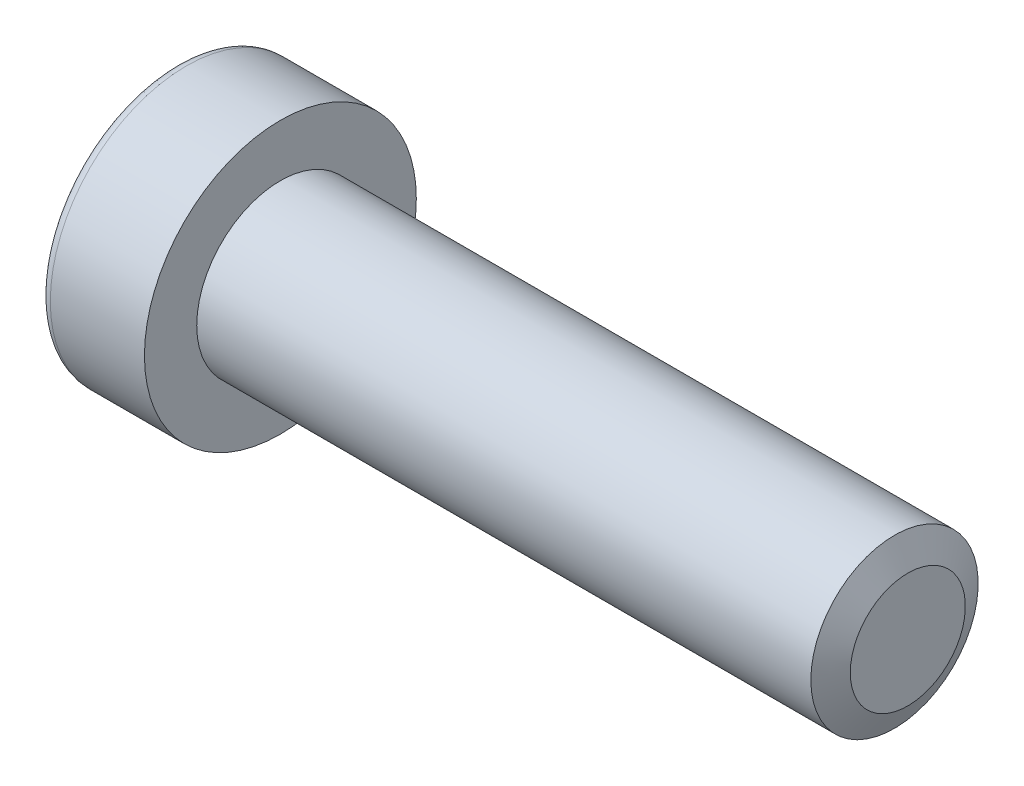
from build123d import *

# Parameters (mm, degrees)
VERRUNDUNG1_R                   = 0.5
SCHNITT_LINEAR_AUSTRAGEN1_DEPTH = 3
FASE1_SIZE                      = 1.25
FASE1_SIZE2                     = 0.636906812


with BuildPart() as part:
    # Skizze1 → Rotation1 (revolve)
    with BuildSketch(Plane.XY, mode=Mode.PRIVATE) as rotation1_sk:
        Polygon((-35, 0), (-35, 6.5), (-30, 6.5), (-30, 4), (0, 4), (0, 0), align=None)
    revolve(rotation1_sk.sketch.rotate(Axis((-65.011808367, 0, 0), (1, 0, 0)), 90), axis=Axis((-65.011808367, 0, 0), (1, 0, 0)))

    # Verrundung1
    verrundung1_edges = [part.edges().sort_by_distance(p)[0] for p in [
        (-35, 0, -6.5),
    ]]
    fillet(verrundung1_edges, radius=VERRUNDUNG1_R)

    # Skizze2 → Schnitt-Linear austragen1 (cut)
    with BuildSketch(Plane.ZY.offset(35)):
        Polygon((2.5, 1.443375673), (0, 2.886751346), (-2.5, 1.443375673), (-2.5, -1.443375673), (0, -2.886751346), (2.5, -1.443375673), align=None)
    extrude(amount=-SCHNITT_LINEAR_AUSTRAGEN1_DEPTH, mode=Mode.SUBTRACT)

    # Fase1
    fase1_edges = [part.edges().sort_by_distance(p)[0] for p in [
        (0, 0, -4),
    ]]
    fase1_side = [part.faces().sort_by_distance(p)[0] for p in [
        (0, 0, 0),
    ]]
    chamfer(fase1_edges, length=FASE1_SIZE, length2=FASE1_SIZE2, reference=fase1_side[0])


solid = part.part
